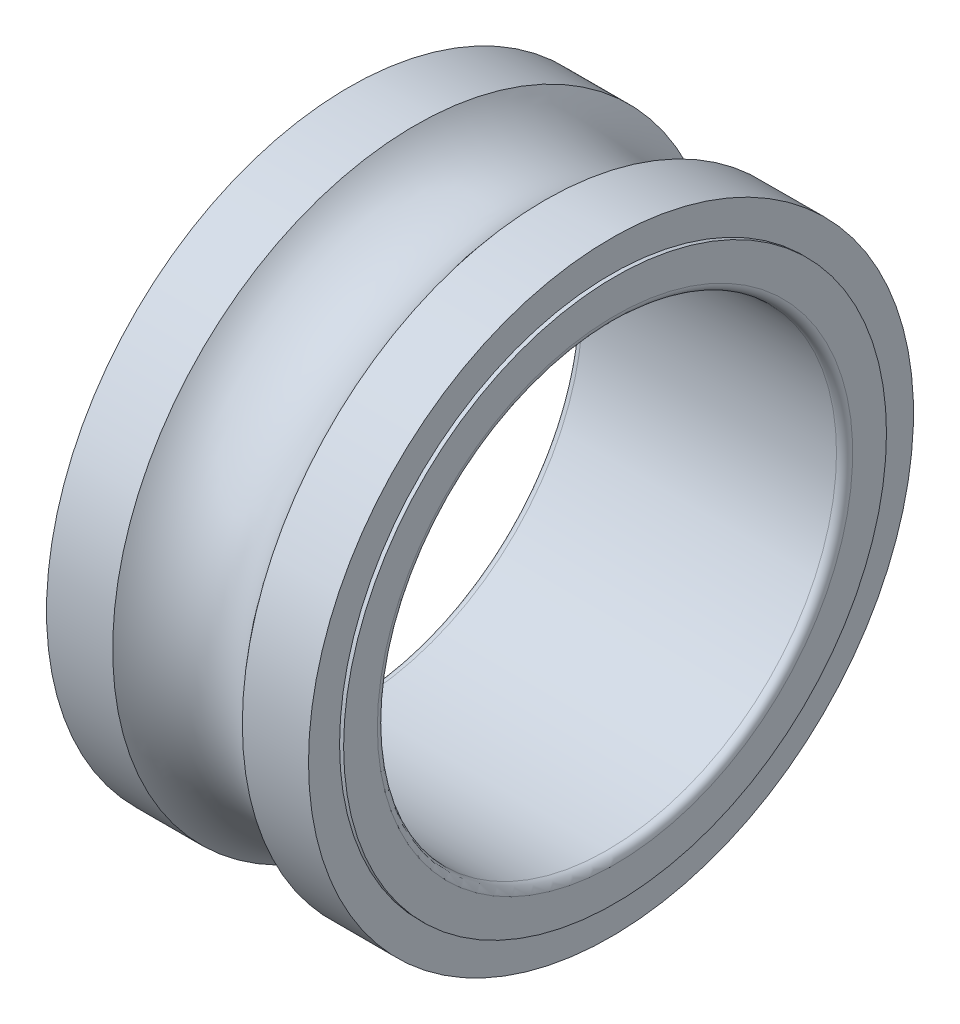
ISO-10303-21;
HEADER;
FILE_DESCRIPTION(('STEP AP214'),'2;1');
FILE_NAME('part.step','',(''),(''),'','','');
FILE_SCHEMA(('AUTOMOTIVE_DESIGN { 1 0 10303 214 1 1 1 1 }'));
ENDSEC;
DATA;
#1=APPLICATION_CONTEXT('core data for automotive mechanical design processes');
#2=APPLICATION_PROTOCOL_DEFINITION('international standard','automotive_design',2000,#1);
#3=PRODUCT_CONTEXT('',#1,'mechanical');
#4=PRODUCT('Part','Part','',(#3));
#5=PRODUCT_RELATED_PRODUCT_CATEGORY('part','',(#4));
#6=PRODUCT_DEFINITION_FORMATION('','',#4);
#7=PRODUCT_DEFINITION_CONTEXT('part definition',#1,'design');
#8=PRODUCT_DEFINITION('design','',#6,#7);
#9=PRODUCT_DEFINITION_SHAPE('','',#8);
#10=(LENGTH_UNIT() NAMED_UNIT(*) SI_UNIT(.MILLI.,.METRE.));
#11=(NAMED_UNIT(*) PLANE_ANGLE_UNIT() SI_UNIT($,.RADIAN.));
#12=(NAMED_UNIT(*) SI_UNIT($,.STERADIAN.) SOLID_ANGLE_UNIT());
#13=UNCERTAINTY_MEASURE_WITH_UNIT(LENGTH_MEASURE(1.E-05),#10,'distance_accuracy_value','');
#14=(GEOMETRIC_REPRESENTATION_CONTEXT(3) GLOBAL_UNCERTAINTY_ASSIGNED_CONTEXT((#13)) GLOBAL_UNIT_ASSIGNED_CONTEXT((#10,
#11,#12)) REPRESENTATION_CONTEXT('',''));
#15=CARTESIAN_POINT('',(0.,0.,0.));
#16=DIRECTION('',(0.,0.,1.));
#17=DIRECTION('',(1.,0.,0.));
#18=AXIS2_PLACEMENT_3D('',#15,#16,#17);
#19=CARTESIAN_POINT('',(-5.,8.8,0.));
#20=DIRECTION('',(-1.,0.,0.));
#21=DIRECTION('',(0.,0.,1.));
#22=AXIS2_PLACEMENT_3D('',#19,#20,#21);
#23=PLANE('',#22);
#24=CARTESIAN_POINT('',(-5.,0.,0.));
#25=DIRECTION('',(-1.,0.,0.));
#26=DIRECTION('',(0.,0.,1.));
#27=AXIS2_PLACEMENT_3D('',#24,#25,#26);
#28=CIRCLE('',#27,8.8);
#29=CARTESIAN_POINT('',(-5.,0.,8.8));
#30=VERTEX_POINT('',#29);
#31=EDGE_CURVE('E45',#30,#30,#28,.T.);
#32=ORIENTED_EDGE('',*,*,#31,.F.);
#33=EDGE_LOOP('',(#32));
#34=FACE_BOUND('',#33,.T.);
#35=CARTESIAN_POINT('',(-5.,0.,0.));
#36=DIRECTION('',(-1.,0.,0.));
#37=DIRECTION('',(0.,0.,1.));
#38=AXIS2_PLACEMENT_3D('',#35,#36,#37);
#39=CIRCLE('',#38,10.05);
#40=CARTESIAN_POINT('',(-5.,0.,10.05));
#41=VERTEX_POINT('',#40);
#42=EDGE_CURVE('E53',#41,#41,#39,.T.);
#43=ORIENTED_EDGE('',*,*,#42,.T.);
#44=EDGE_LOOP('',(#43));
#45=FACE_BOUND('',#44,.T.);
#46=ADVANCED_FACE('F13',(#34,#45),#23,.T.);
#47=CARTESIAN_POINT('',(5.,8.8,0.));
#48=DIRECTION('',(-1.,0.,0.));
#49=DIRECTION('',(0.,0.,1.));
#50=AXIS2_PLACEMENT_3D('',#47,#48,#49);
#51=PLANE('',#50);
#52=CARTESIAN_POINT('',(5.,0.,0.));
#53=DIRECTION('',(-1.,0.,0.));
#54=DIRECTION('',(0.,0.,1.));
#55=AXIS2_PLACEMENT_3D('',#52,#53,#54);
#56=CIRCLE('',#55,8.8);
#57=CARTESIAN_POINT('',(5.,0.,8.8));
#58=VERTEX_POINT('',#57);
#59=EDGE_CURVE('E32',#58,#58,#56,.T.);
#60=ORIENTED_EDGE('',*,*,#59,.T.);
#61=EDGE_LOOP('',(#60));
#62=FACE_BOUND('',#61,.T.);
#63=CARTESIAN_POINT('',(5.,0.,0.));
#64=DIRECTION('',(-1.,0.,0.));
#65=DIRECTION('',(0.,0.,1.));
#66=AXIS2_PLACEMENT_3D('',#63,#64,#65);
#67=CIRCLE('',#66,10.05);
#68=CARTESIAN_POINT('',(5.,0.,10.05));
#69=VERTEX_POINT('',#68);
#70=EDGE_CURVE('E46',#69,#69,#67,.T.);
#71=ORIENTED_EDGE('',*,*,#70,.F.);
#72=EDGE_LOOP('',(#71));
#73=FACE_BOUND('',#72,.T.);
#74=ADVANCED_FACE('F82',(#62,#73),#51,.F.);
#75=CARTESIAN_POINT('',(0.,0.,0.));
#76=DIRECTION('',(-1.,0.,0.));
#77=DIRECTION('',(0.,0.,1.));
#78=AXIS2_PLACEMENT_3D('',#75,#76,#77);
#79=CYLINDRICAL_SURFACE('',#78,11.2);
#80=CARTESIAN_POINT('',(4.85,0.,0.));
#81=DIRECTION('',(-1.,0.,0.));
#82=DIRECTION('',(0.,0.,1.));
#83=AXIS2_PLACEMENT_3D('',#80,#81,#82);
#84=CIRCLE('',#83,11.2);
#85=CARTESIAN_POINT('',(4.85,0.,11.2));
#86=VERTEX_POINT('',#85);
#87=EDGE_CURVE('E41',#86,#86,#84,.F.);
#88=ORIENTED_EDGE('',*,*,#87,.F.);
#89=EDGE_LOOP('',(#88));
#90=FACE_BOUND('',#89,.T.);
#91=CARTESIAN_POINT('',(2.4,0.,0.));
#92=DIRECTION('',(-1.,0.,0.));
#93=DIRECTION('',(0.,0.,1.));
#94=AXIS2_PLACEMENT_3D('',#91,#92,#93);
#95=CIRCLE('',#94,11.2);
#96=CARTESIAN_POINT('',(2.4,0.,11.2));
#97=VERTEX_POINT('',#96);
#98=EDGE_CURVE('E40',#97,#97,#95,.T.);
#99=ORIENTED_EDGE('',*,*,#98,.F.);
#100=EDGE_LOOP('',(#99));
#101=FACE_BOUND('',#100,.T.);
#102=ADVANCED_FACE('F98',(#90,#101),#79,.T.);
#103=CARTESIAN_POINT('',(-4.7,0.,0.));
#104=DIRECTION('',(-1.,0.,0.));
#105=DIRECTION('',(0.,0.,1.));
#106=AXIS2_PLACEMENT_3D('',#103,#104,#105);
#107=TOROIDAL_SURFACE('',#106,8.8,0.3);
#108=CARTESIAN_POINT('',(-4.7,0.,0.));
#109=DIRECTION('',(-1.,0.,0.));
#110=DIRECTION('',(0.,0.,1.));
#111=AXIS2_PLACEMENT_3D('',#108,#109,#110);
#112=CIRCLE('',#111,8.5);
#113=CARTESIAN_POINT('',(-4.7,0.,8.5));
#114=VERTEX_POINT('',#113);
#115=EDGE_CURVE('E9',#114,#114,#112,.T.);
#116=ORIENTED_EDGE('',*,*,#115,.F.);
#117=EDGE_LOOP('',(#116));
#118=FACE_BOUND('',#117,.T.);
#119=ORIENTED_EDGE('',*,*,#31,.T.);
#120=EDGE_LOOP('',(#119));
#121=FACE_BOUND('',#120,.T.);
#122=ADVANCED_FACE('F15',(#118,#121),#107,.T.);
#123=CARTESIAN_POINT('',(0.,0.,0.));
#124=DIRECTION('',(-1.,0.,0.));
#125=DIRECTION('',(0.,0.,1.));
#126=AXIS2_PLACEMENT_3D('',#123,#124,#125);
#127=CYLINDRICAL_SURFACE('',#126,8.5);
#128=CARTESIAN_POINT('',(4.7,0.,0.));
#129=DIRECTION('',(-1.,0.,0.));
#130=DIRECTION('',(0.,0.,1.));
#131=AXIS2_PLACEMENT_3D('',#128,#129,#130);
#132=CIRCLE('',#131,8.5);
#133=CARTESIAN_POINT('',(4.7,0.,8.5));
#134=VERTEX_POINT('',#133);
#135=EDGE_CURVE('E22',#134,#134,#132,.T.);
#136=ORIENTED_EDGE('',*,*,#135,.F.);
#137=EDGE_LOOP('',(#136));
#138=FACE_BOUND('',#137,.T.);
#139=ORIENTED_EDGE('',*,*,#115,.T.);
#140=EDGE_LOOP('',(#139));
#141=FACE_BOUND('',#140,.T.);
#142=ADVANCED_FACE('F89',(#138,#141),#127,.F.);
#143=CARTESIAN_POINT('',(4.7,0.,0.));
#144=DIRECTION('',(-1.,0.,0.));
#145=DIRECTION('',(0.,0.,1.));
#146=AXIS2_PLACEMENT_3D('',#143,#144,#145);
#147=TOROIDAL_SURFACE('',#146,8.8,0.3);
#148=ORIENTED_EDGE('',*,*,#59,.F.);
#149=EDGE_LOOP('',(#148));
#150=FACE_BOUND('',#149,.T.);
#151=ORIENTED_EDGE('',*,*,#135,.T.);
#152=EDGE_LOOP('',(#151));
#153=FACE_BOUND('',#152,.T.);
#154=ADVANCED_FACE('F85',(#150,#153),#147,.T.);
#155=CARTESIAN_POINT('',(-4.85,0.,0.));
#156=DIRECTION('',(1.,0.,0.));
#157=DIRECTION('',(0.,0.,-1.));
#158=AXIS2_PLACEMENT_3D('',#155,#156,#157);
#159=CIRCLE('',#158,11.2);
#160=CARTESIAN_POINT('',(-4.85,0.,-11.2));
#161=VERTEX_POINT('',#160);
#162=EDGE_CURVE('E17',#161,#161,#159,.F.);
#163=ORIENTED_EDGE('',*,*,#162,.F.);
#164=EDGE_LOOP('',(#163));
#165=FACE_BOUND('',#164,.T.);
#166=CARTESIAN_POINT('',(-2.4,0.,0.));
#167=DIRECTION('',(1.,0.,0.));
#168=DIRECTION('',(0.,0.,-1.));
#169=AXIS2_PLACEMENT_3D('',#166,#167,#168);
#170=CIRCLE('',#169,11.2);
#171=CARTESIAN_POINT('',(-2.4,0.,-11.2));
#172=VERTEX_POINT('',#171);
#173=EDGE_CURVE('E36',#172,#172,#170,.T.);
#174=ORIENTED_EDGE('',*,*,#173,.F.);
#175=EDGE_LOOP('',(#174));
#176=FACE_BOUND('',#175,.T.);
#177=ADVANCED_FACE('F88',(#165,#176),#79,.T.);
#178=CARTESIAN_POINT('',(0.,0.,0.));
#179=DIRECTION('',(1.,0.,0.));
#180=DIRECTION('',(0.,-1.,0.));
#181=AXIS2_PLACEMENT_3D('',#178,#179,#180);
#182=TOROIDAL_SURFACE('',#181,13.,3.);
#183=ORIENTED_EDGE('',*,*,#98,.T.);
#184=EDGE_LOOP('',(#183));
#185=FACE_BOUND('',#184,.T.);
#186=ORIENTED_EDGE('',*,*,#173,.T.);
#187=EDGE_LOOP('',(#186));
#188=FACE_BOUND('',#187,.T.);
#189=ADVANCED_FACE('F110',(#185,#188),#182,.F.);
#190=CARTESIAN_POINT('',(3.85,0.,0.));
#191=DIRECTION('',(1.,0.,0.));
#192=DIRECTION('',(0.,-1.,0.));
#193=AXIS2_PLACEMENT_3D('',#190,#191,#192);
#194=CYLINDRICAL_SURFACE('',#193,10.05);
#195=CARTESIAN_POINT('',(4.85,0.,0.));
#196=DIRECTION('',(-1.,0.,0.));
#197=DIRECTION('',(0.,0.,1.));
#198=AXIS2_PLACEMENT_3D('',#195,#196,#197);
#199=CIRCLE('',#198,10.05);
#200=CARTESIAN_POINT('',(4.85,0.,10.05));
#201=VERTEX_POINT('',#200);
#202=EDGE_CURVE('E50',#201,#201,#199,.T.);
#203=ORIENTED_EDGE('',*,*,#202,.F.);
#204=EDGE_LOOP('',(#203));
#205=FACE_BOUND('',#204,.T.);
#206=ORIENTED_EDGE('',*,*,#70,.T.);
#207=EDGE_LOOP('',(#206));
#208=FACE_BOUND('',#207,.T.);
#209=ADVANCED_FACE('F117',(#205,#208),#194,.T.);
#210=CARTESIAN_POINT('',(4.85,0.,0.));
#211=DIRECTION('',(-1.,0.,0.));
#212=DIRECTION('',(0.,0.,1.));
#213=AXIS2_PLACEMENT_3D('',#210,#211,#212);
#214=PLANE('',#213);
#215=ORIENTED_EDGE('',*,*,#87,.T.);
#216=EDGE_LOOP('',(#215));
#217=FACE_BOUND('',#216,.T.);
#218=ORIENTED_EDGE('',*,*,#202,.T.);
#219=EDGE_LOOP('',(#218));
#220=FACE_BOUND('',#219,.T.);
#221=ADVANCED_FACE('F131',(#217,#220),#214,.F.);
#222=CARTESIAN_POINT('',(-4.85,0.,0.));
#223=DIRECTION('',(1.,0.,0.));
#224=DIRECTION('',(0.,0.,-1.));
#225=AXIS2_PLACEMENT_3D('',#222,#223,#224);
#226=PLANE('',#225);
#227=ORIENTED_EDGE('',*,*,#162,.T.);
#228=EDGE_LOOP('',(#227));
#229=FACE_BOUND('',#228,.T.);
#230=CARTESIAN_POINT('',(-4.85,0.,0.));
#231=DIRECTION('',(1.,0.,0.));
#232=DIRECTION('',(0.,0.,-1.));
#233=AXIS2_PLACEMENT_3D('',#230,#231,#232);
#234=CIRCLE('',#233,10.05);
#235=CARTESIAN_POINT('',(-4.85,0.,-10.05));
#236=VERTEX_POINT('',#235);
#237=EDGE_CURVE('E56',#236,#236,#234,.T.);
#238=ORIENTED_EDGE('',*,*,#237,.T.);
#239=EDGE_LOOP('',(#238));
#240=FACE_BOUND('',#239,.T.);
#241=ADVANCED_FACE('F134',(#229,#240),#226,.F.);
#242=CARTESIAN_POINT('',(-3.85,0.,0.));
#243=DIRECTION('',(-1.,0.,0.));
#244=DIRECTION('',(0.,-1.,0.));
#245=AXIS2_PLACEMENT_3D('',#242,#243,#244);
#246=CYLINDRICAL_SURFACE('',#245,10.05);
#247=ORIENTED_EDGE('',*,*,#42,.F.);
#248=EDGE_LOOP('',(#247));
#249=FACE_BOUND('',#248,.T.);
#250=ORIENTED_EDGE('',*,*,#237,.F.);
#251=EDGE_LOOP('',(#250));
#252=FACE_BOUND('',#251,.T.);
#253=ADVANCED_FACE('F146',(#249,#252),#246,.T.);
#254=CLOSED_SHELL('',(#46,#74,#102,#122,#142,#154,#177,#189,#209,#221,#241,#253));
#255=MANIFOLD_SOLID_BREP('B1',#254);
#256=ADVANCED_BREP_SHAPE_REPRESENTATION('',(#18,#255),#14);
#257=SHAPE_DEFINITION_REPRESENTATION(#9,#256);
ENDSEC;
END-ISO-10303-21;
